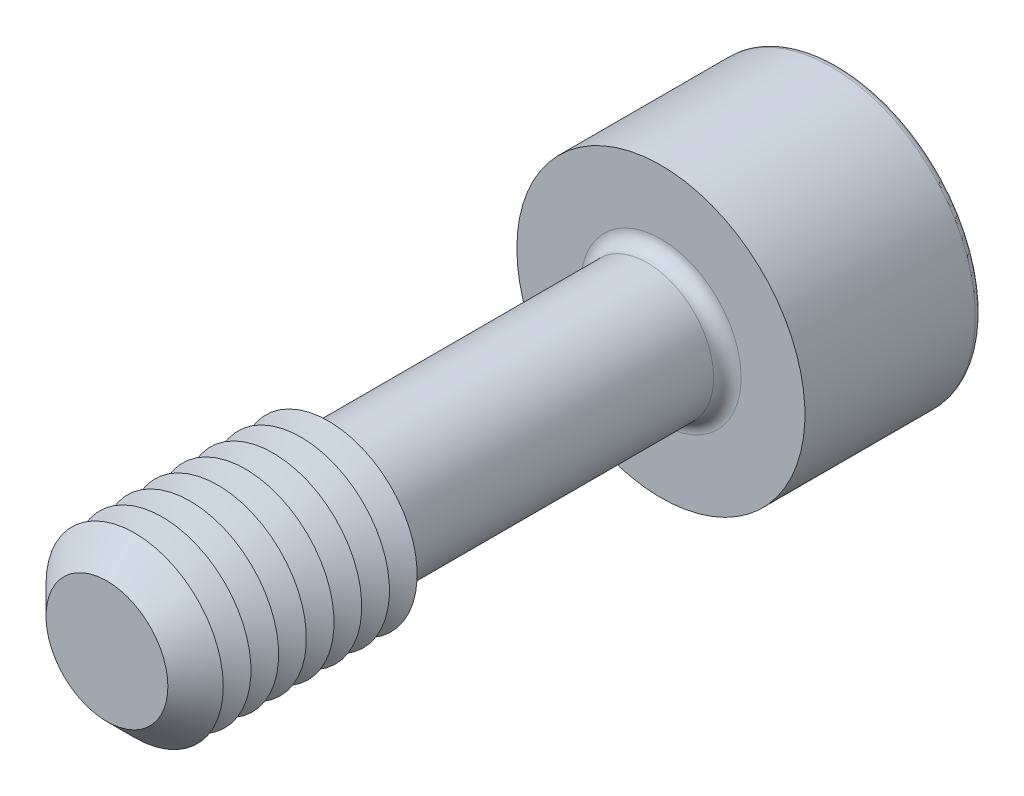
from build123d import *

# Parameters (mm, degrees)
SKETCH1_R       = 3
EXTRUDE1_DEPTH  = 12.5
CHAMFER1_SIZE   = 1.25
SKETCH3_R       = 6.5
EXTRUDE2_DEPTH  = 8
EXTRUDE3_DEPTH  = 6
FILLET1_R       = 0.62
FILLET2_R       = 0.31
LPATTERN1_COUNT = 7
LPATTERN1_PITCH = 1.25


with BuildPart() as part:
    # Sketch1 → Extrude1 (new, symmetric)
    with BuildSketch(Plane.XY):
        Circle(SKETCH1_R)
    extrude(amount=EXTRUDE1_DEPTH, both=True)

    # Sketch2 → Revolve1 (revolve)
    with BuildSketch(Plane(origin=(0, 0, 0), x_dir=(0, 0, -1), z_dir=(1, 0, 0))):
        Polygon((-12.5, 0), (-12.5, 4), (-2.5, 4), (-1.922649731, 3), (-1.922649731, 0), align=None)
    revolve(axis=Axis((0, 0, 1.922649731), (0, 0, 1)))

    # Chamfer1
    chamfer1_edges = [part.edges().sort_by_distance(p)[0] for p in [
        (0, -4, 12.5),
    ]]
    chamfer(chamfer1_edges, length=CHAMFER1_SIZE)

    # Sketch3 → Extrude2 (add)
    with BuildSketch(Plane(origin=(0, 0, -12.5), x_dir=(-1, 0, 0), z_dir=(0, 0, -1))):
        Circle(SKETCH3_R)
    extrude(amount=EXTRUDE2_DEPTH)

    # Sketch4 → Extrude3 (cut)
    with BuildSketch(Plane(origin=(-13.7, 0, -20.5), x_dir=(1, 0, 0), z_dir=(0, 0, 1))):
        Polygon((11.967949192, -3), (15.432050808, -3), (17.164101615, 0), (15.432050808, 3), (11.967949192, 3), (10.235898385, 0), align=None)
    extrude(amount=EXTRUDE3_DEPTH, mode=Mode.SUBTRACT)

    # Fillet1
    fillet1_edges = [part.edges().sort_by_distance(p)[0] for p in [
        (-3, 0, -12.5),
    ]]
    fillet(fillet1_edges, radius=FILLET1_R)

    # Fillet2
    fillet2_edges = [part.edges().sort_by_distance(p)[0] for p in [
        (6.5, 0, -20.5),
    ]]
    fillet(fillet2_edges, radius=FILLET2_R)

    # Sketch5 → Cut-Revolve1 (revolve, cut)
    with BuildSketch(Plane(origin=(0, 0, 0), x_dir=(0, 0, -1), z_dir=(1, 0, 0)), mode=Mode.PRIVATE) as cut_revolve1_sk:
        Polygon((14.5, 0), (14.5, -3), (12.767949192, 0), align=None)
    revolve(cut_revolve1_sk.sketch.rotate(Axis((0, 0, -12.767949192), (0, 0, -1)), 90), axis=Axis((0, 0, -12.767949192), (0, 0, -1)), mode=Mode.SUBTRACT)

    # Sketch7 → Cut-Revolve2 (revolve, cut)
    with BuildSketch(Plane(origin=(0, 0, 0), x_dir=(0, 0, -1), z_dir=(1, 0, 0)), mode=Mode.PRIVATE) as cut_revolve2_sk:
        Polygon((-2.5, 4), (-3.125, 2.917468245), (-3.75, 4), align=None)
    cut_revolve2 = revolve(cut_revolve2_sk.sketch.rotate(Axis((0, 0, -1.332048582), (0, 0, 1)), 90), axis=Axis((0, 0, -1.332048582), (0, 0, 1)), mode=Mode.SUBTRACT)

    # LPattern1: Cut-Revolve2 ×7
    with Locations(*[(0, 0, i * LPATTERN1_PITCH) for i in range(1, LPATTERN1_COUNT)]):
        add(cut_revolve2, mode=Mode.SUBTRACT)


solid = part.part
